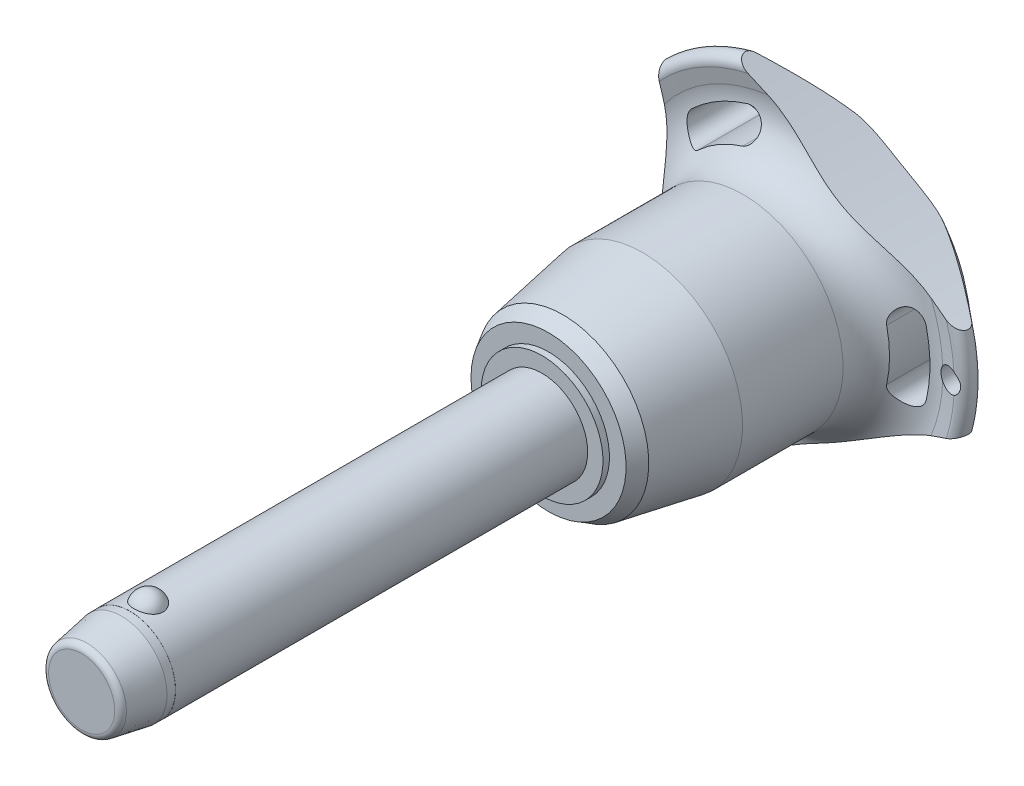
from build123d import *

# Parameters (mm, degrees)
SKETCH1_R           = 6
BOSS_EXTRUDE1_DEPTH = 50
SKETCH2_R           = 5.15
BOSS_EXTRUDE2_DEPTH = 39.7
BOSS_EXTRUDE3_START = 10.6
SKETCH1_2_R         = 6
BOSS_EXTRUDE3_DEPTH = 10.6
CHAMFER1_SIZE       = 5.3
CHAMFER1_SIZE2      = 0.934532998
FILLET1_R           = 0.85
SKETCH6_R           = 144.275
CUT_EXTRUDE1_DEPTH  = 96.809732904
CIRPATTERN1_COUNT   = 3
SKETCH7_R           = 1.5
CUT_EXTRUDE2_DEPTH  = 96.600036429
SKETCH8_R           = 6
SKETCH8_R_2         = 5.99
CUT_EXTRUDE3_DEPTH  = 6.36


with BuildPart() as part:
    # Sketch1 → Boss-Extrude1 (new body)
    with BuildSketch(Plane.XY):
        Circle(SKETCH1_R)
    extrude(amount=-BOSS_EXTRUDE1_DEPTH)

    # Sketch2 → Boss-Extrude2 (add)
    with BuildSketch(Plane(origin=(0, 0, -50), x_dir=(-1, 0, 0), z_dir=(0, 0, -1))):
        Circle(SKETCH2_R)
    extrude(amount=BOSS_EXTRUDE2_DEPTH)

    # Sketch3 → Revolve1 (revolve)
    with BuildSketch(Plane(origin=(0, 0, 0), x_dir=(0, 0, -1), z_dir=(1, 0, 0))):
        with BuildLine():
            Line((-1.854049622, 7.25), (-1.854049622, 3.25))
            ThreePointArc((-1.854049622, 3.25), (0.145950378, 5.25), (-1.854049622, 7.25))
        make_face()
        with BuildLine():
            Line((-1.854049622, -3.25), (-1.854049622, -7.25))
            ThreePointArc((-1.854049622, -7.25), (0.145950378, -5.25), (-1.854049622, -3.25))
        make_face()
    revolve(axis=Axis((0, -3.25, 1.854049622), (0, 1, 0)))

    # Sketch1_2 → Boss-Extrude3 (add)
    with BuildSketch(Plane.XY.offset(BOSS_EXTRUDE3_START)):
        Circle(SKETCH1_2_R)
    extrude(amount=-BOSS_EXTRUDE3_DEPTH)

    # Chamfer1
    chamfer1_edges = [part.edges().sort_by_distance(p)[0] for p in [
        (-6, 0, 10.6),
    ]]
    chamfer1_side = [part.faces().sort_by_distance(p)[0] for p in [
        (-6, 0, -19.7),
    ]]
    chamfer(chamfer1_edges, length=CHAMFER1_SIZE, length2=CHAMFER1_SIZE2, reference=chamfer1_side[0])

    # Fillet1
    fillet1_edges = [part.edges().sort_by_distance(p)[0] for p in [
        (-5.065467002, 0, 10.6),
        (5.15, 0, -89.7),
    ]]
    fillet(fillet1_edges, radius=FILLET1_R)

    # Sketch4 → Revolve2 (revolve)
    with BuildSketch(Plane(origin=(0, 0, 0), x_dir=(0, 0, -1), z_dir=(1, 0, 0)), mode=Mode.PRIVATE) as revolve2_sk:
        Polygon((50, 0), (50, 8.017240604), (50.85, 8.017240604), (50.85, 10.206249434), (52.745737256, 11.300753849), (63.233333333, 13.15), (76.466666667, 13.15), (76.466666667, 0), align=None)
    revolve(revolve2_sk.sketch.rotate(Axis((0, 0, -76.466666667), (0, 0, 1)), 90), axis=Axis((0, 0, -76.466666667), (0, 0, 1)))

    # Sketch5 → Revolve3 (revolve)
    with BuildSketch(Plane(origin=(0, 0, 0), x_dir=(0, 0, -1), z_dir=(1, 0, 0)), mode=Mode.PRIVATE) as revolve3_sk:
        with BuildLine():
            Line((82.32877039, 20.428960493), (81.910912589, 22.344207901))
            ThreePointArc((81.910912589, 22.344207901), (82.554394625, 23.677136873), (84.002586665, 23.371345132))
            Line((84.002586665, 23.371345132), (89.141488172, 17.247040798))
            ThreePointArc((89.141488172, 17.247040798), (89.7, 15.584758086), (88.978803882, 13.986322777))
            ThreePointArc((88.978803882, 13.986322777), (84.617427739, 7.589034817), (83.083333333, 0))
            Line((83.083333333, 0), (76.466666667, 0))
            Line((76.466666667, 0), (76.466666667, 13.15))
            ThreePointArc((76.466666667, 13.15), (81.139661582, 15.38660811), (82.32877039, 20.428960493))
        make_face()
    revolve(revolve3_sk.sketch.rotate(Axis((0, 0, -83.083333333), (0, 0, 1)), 90), axis=Axis((0, 0, -83.083333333), (0, 0, 1)))

    # Sketch6 → Cut-Extrude1 (cut, through all)
    with BuildSketch(Plane.XY):
        with Locations((-159.975, 0)):
            Circle(SKETCH6_R)
        with BuildLine():
            ThreePointArc((18.131206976, -4.190753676), (18.60922037, 0), (18.131206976, 4.190753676))
            ThreePointArc((18.131206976, 4.190753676), (15.94840906, 5.553949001), (14.585213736, 3.371151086))
            ThreePointArc((14.585213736, 3.371151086), (14.969740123, 0), (14.585213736, -3.371151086))
            ThreePointArc((14.585213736, -3.371151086), (15.94840906, -5.553949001), (18.131206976, -4.190753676))
        make_face()
    cut_extrude1 = extrude(amount=-CUT_EXTRUDE1_DEPTH, mode=Mode.SUBTRACT)

    # CirPattern1: Cut-Extrude1 ×3 about axis
    cirpattern1_axis = Axis((0, 0, 0), (0, 0, 1))
    for i in range(1, CIRPATTERN1_COUNT):
        add(cut_extrude1.rotate(cirpattern1_axis, i * 360 / CIRPATTERN1_COUNT), mode=Mode.SUBTRACT)

    # Sketch7 → Cut-Extrude2 (cut, through all)
    with BuildSketch(Plane.XY):
        with Locations(Location((21.60922037, 0, 0), (0, 0, 297.620773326))):
            Circle(SKETCH7_R)
    extrude(amount=-CUT_EXTRUDE2_DEPTH, mode=Mode.SUBTRACT)

    # Sketch8 → Cut-Extrude3 (cut)
    with BuildSketch(Plane.XY.offset(10.6)):
        Circle(SKETCH8_R)
        Circle(SKETCH8_R_2, mode=Mode.SUBTRACT)
    extrude(amount=-CUT_EXTRUDE3_DEPTH, mode=Mode.SUBTRACT)


solid = part.part
